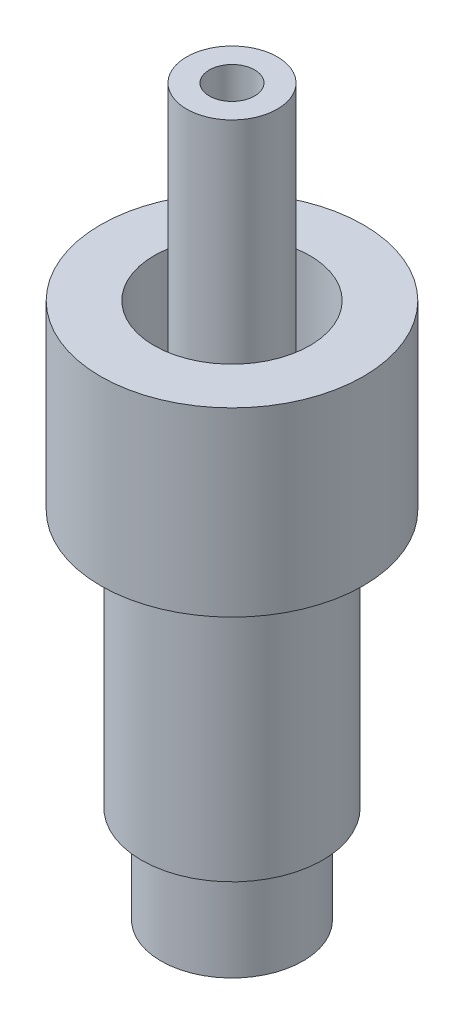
from build123d import *

# Parameters (mm, degrees)
SKETCH2_R           = 2.4892
SKETCH2_R_2         = 1.5875
BOSS_EXTRUDE1_DEPTH = 3.4036
SKETCH3_R           = 2.7305
CUT_EXTRUDE1_DEPTH  = 5.461
SKETCH4_R           = 1.5875
SKETCH4_R_2         = 0.79375
BOSS_EXTRUDE2_DEPTH = 25.4


with BuildPart() as part:
    # Sketch1 → Revolve1 (revolve)
    with BuildSketch(Plane.XY, mode=Mode.PRIVATE) as revolve1_sk:
        Polygon((-1.5875, 0), (-4.60375, 0), (-4.60375, -6.35), (-3.175, -6.35), (-3.175, -15.3924), (-1.5875, -15.3924), align=None)
    revolve(revolve1_sk.sketch.rotate(Axis((0, 0, 0), (0, -1, 0)), 270), axis=Axis((0, 0, 0), (0, -1, 0)))

    # Sketch3 → Cut-Extrude1 (cut)
    with BuildSketch(Plane(origin=(0, 0, 0), x_dir=(1, 0, 0), z_dir=(0, 1, 0))):
        with Locations(Location((0, 0, 0), (0, 0, 270))):
            Circle(SKETCH3_R)
    extrude(amount=-CUT_EXTRUDE1_DEPTH, mode=Mode.SUBTRACT)


with BuildPart() as body_2:
    # Sketch2 → Boss-Extrude1 (new body)
    with BuildSketch(Plane.XZ.offset(15.3924)):
        with Locations(Location((0, 0, 0), (0, 0, 90))):
            Circle(SKETCH2_R)
        with Locations(Location((0, 0, 0), (0, 0, 90))):
            Circle(SKETCH2_R_2, mode=Mode.SUBTRACT)
    extrude(amount=BOSS_EXTRUDE1_DEPTH)


with BuildPart() as body_3:
    # Sketch4 → Boss-Extrude2 (new body)
    with BuildSketch(Plane.XZ.offset(18.796)):
        with Locations(Location((0, 0, 0), (0, 0, 270))):
            Circle(SKETCH4_R)
        with Locations(Location((0, 0, 0), (0, 0, 270))):
            Circle(SKETCH4_R_2, mode=Mode.SUBTRACT)
    extrude(amount=-BOSS_EXTRUDE2_DEPTH)


solid = Compound([part.part, body_2.part, body_3.part])
